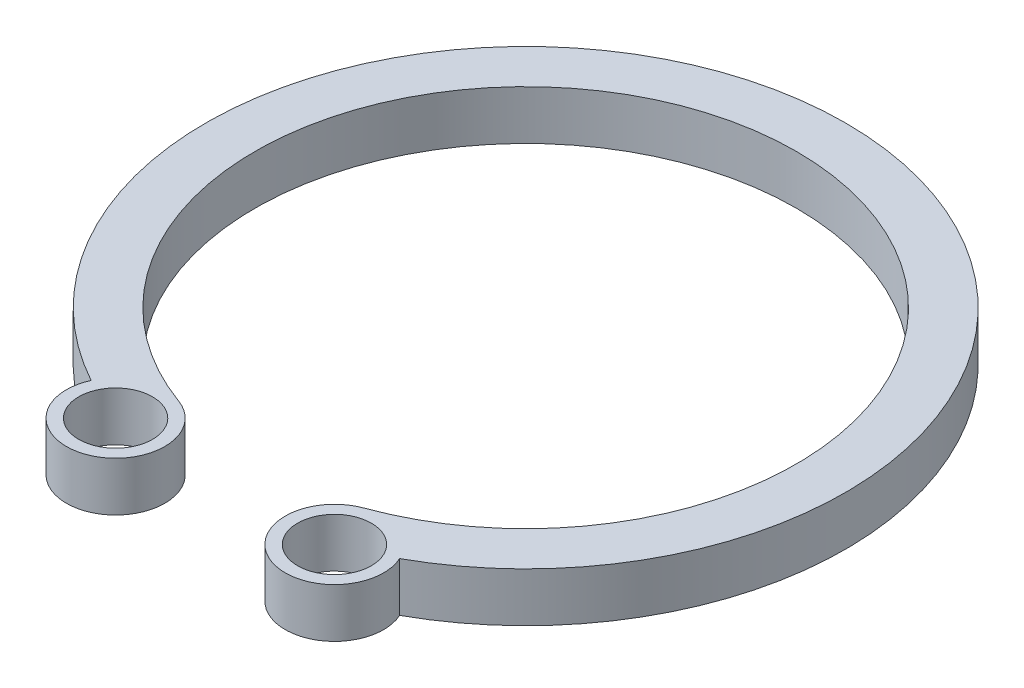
ISO-10303-21;
HEADER;
FILE_DESCRIPTION(('STEP AP214'),'2;1');
FILE_NAME('part.step','',(''),(''),'','','');
FILE_SCHEMA(('AUTOMOTIVE_DESIGN { 1 0 10303 214 1 1 1 1 }'));
ENDSEC;
DATA;
#1=APPLICATION_CONTEXT('core data for automotive mechanical design processes');
#2=APPLICATION_PROTOCOL_DEFINITION('international standard','automotive_design',2000,#1);
#3=PRODUCT_CONTEXT('',#1,'mechanical');
#4=PRODUCT('Part','Part','',(#3));
#5=PRODUCT_RELATED_PRODUCT_CATEGORY('part','',(#4));
#6=PRODUCT_DEFINITION_FORMATION('','',#4);
#7=PRODUCT_DEFINITION_CONTEXT('part definition',#1,'design');
#8=PRODUCT_DEFINITION('design','',#6,#7);
#9=PRODUCT_DEFINITION_SHAPE('','',#8);
#10=(LENGTH_UNIT() NAMED_UNIT(*) SI_UNIT(.MILLI.,.METRE.));
#11=(NAMED_UNIT(*) PLANE_ANGLE_UNIT() SI_UNIT($,.RADIAN.));
#12=(NAMED_UNIT(*) SI_UNIT($,.STERADIAN.) SOLID_ANGLE_UNIT());
#13=UNCERTAINTY_MEASURE_WITH_UNIT(LENGTH_MEASURE(1.E-05),#10,'distance_accuracy_value','');
#14=(GEOMETRIC_REPRESENTATION_CONTEXT(3) GLOBAL_UNCERTAINTY_ASSIGNED_CONTEXT((#13)) GLOBAL_UNIT_ASSIGNED_CONTEXT((#10,
#11,#12)) REPRESENTATION_CONTEXT('',''));
#15=CARTESIAN_POINT('',(0.,0.,0.));
#16=DIRECTION('',(0.,0.,1.));
#17=DIRECTION('',(1.,0.,0.));
#18=AXIS2_PLACEMENT_3D('',#15,#16,#17);
#19=CARTESIAN_POINT('',(-1.11156546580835,1.,3.05400101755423));
#20=DIRECTION('',(0.,1.,0.));
#21=DIRECTION('',(0.,0.,1.));
#22=AXIS2_PLACEMENT_3D('',#19,#20,#21);
#23=PLANE('',#22);
#24=CARTESIAN_POINT('',(-2.22313093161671,1.,6.10800203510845));
#25=DIRECTION('',(0.,1.,0.));
#26=DIRECTION('',(0.,0.,1.));
#27=AXIS2_PLACEMENT_3D('',#24,#25,#26);
#28=CIRCLE('',#27,0.75);
#29=CARTESIAN_POINT('',(-2.22313093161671,1.,6.85800203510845));
#30=VERTEX_POINT('',#29);
#31=EDGE_CURVE('E101',#30,#30,#28,.T.);
#32=ORIENTED_EDGE('',*,*,#31,.F.);
#33=EDGE_LOOP('',(#32));
#34=FACE_BOUND('',#33,.T.);
#35=CARTESIAN_POINT('',(-2.22313093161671,1.,6.10800203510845));
#36=DIRECTION('',(0.,1.,0.));
#37=DIRECTION('',(0.,0.,1.));
#38=AXIS2_PLACEMENT_3D('',#35,#36,#37);
#39=CIRCLE('',#38,0.999999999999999);
#40=CARTESIAN_POINT('',(-3.1337300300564,1.,5.6947112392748));
#41=VERTEX_POINT('',#40);
#42=CARTESIAN_POINT('',(-1.88111078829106,1.,5.16830941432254));
#43=VERTEX_POINT('',#42);
#44=EDGE_CURVE('E86',#41,#43,#39,.T.);
#45=ORIENTED_EDGE('',*,*,#44,.T.);
#46=CARTESIAN_POINT('',(0.,1.,0.));
#47=DIRECTION('',(0.,-1.,0.));
#48=DIRECTION('',(0.,0.,1.));
#49=AXIS2_PLACEMENT_3D('',#46,#47,#48);
#50=CIRCLE('',#49,5.5);
#51=CARTESIAN_POINT('',(1.88111078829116,1.,5.1683094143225));
#52=VERTEX_POINT('',#51);
#53=EDGE_CURVE('E81',#43,#52,#50,.T.);
#54=ORIENTED_EDGE('',*,*,#53,.T.);
#55=CARTESIAN_POINT('',(2.22313093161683,1.,6.10800203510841));
#56=DIRECTION('',(0.,1.,0.));
#57=DIRECTION('',(0.,0.,1.));
#58=AXIS2_PLACEMENT_3D('',#55,#56,#57);
#59=CIRCLE('',#58,0.999999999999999);
#60=CARTESIAN_POINT('',(3.13373003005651,1.,5.69471123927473));
#61=VERTEX_POINT('',#60);
#62=EDGE_CURVE('E84',#52,#61,#59,.T.);
#63=ORIENTED_EDGE('',*,*,#62,.T.);
#64=CARTESIAN_POINT('',(0.,1.,0.));
#65=DIRECTION('',(0.,1.,0.));
#66=DIRECTION('',(0.,0.,1.));
#67=AXIS2_PLACEMENT_3D('',#64,#65,#66);
#68=CIRCLE('',#67,6.5);
#69=EDGE_CURVE('E51',#61,#41,#68,.T.);
#70=ORIENTED_EDGE('',*,*,#69,.T.);
#71=EDGE_LOOP('',(#45,#54,#63,#70));
#72=FACE_BOUND('',#71,.T.);
#73=CARTESIAN_POINT('',(2.22313093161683,1.,6.10800203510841));
#74=DIRECTION('',(0.,1.,0.));
#75=DIRECTION('',(0.,0.,-1.));
#76=AXIS2_PLACEMENT_3D('',#73,#74,#75);
#77=CIRCLE('',#76,0.750000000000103);
#78=CARTESIAN_POINT('',(2.22313093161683,1.,5.35800203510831));
#79=VERTEX_POINT('',#78);
#80=EDGE_CURVE('E116',#79,#79,#77,.T.);
#81=ORIENTED_EDGE('',*,*,#80,.F.);
#82=EDGE_LOOP('',(#81));
#83=FACE_BOUND('',#82,.T.);
#84=ADVANCED_FACE('F34',(#34,#72,#83),#23,.T.);
#85=CARTESIAN_POINT('',(-1.11156546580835,0.,3.05400101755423));
#86=DIRECTION('',(0.,1.,0.));
#87=DIRECTION('',(0.,0.,1.));
#88=AXIS2_PLACEMENT_3D('',#85,#86,#87);
#89=PLANE('',#88);
#90=CARTESIAN_POINT('',(-2.22313093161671,0.,6.10800203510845));
#91=DIRECTION('',(0.,1.,0.));
#92=DIRECTION('',(0.,0.,1.));
#93=AXIS2_PLACEMENT_3D('',#90,#91,#92);
#94=CIRCLE('',#93,0.999999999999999);
#95=CARTESIAN_POINT('',(-3.1337300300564,0.,5.6947112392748));
#96=VERTEX_POINT('',#95);
#97=CARTESIAN_POINT('',(-1.88111078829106,0.,5.16830941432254));
#98=VERTEX_POINT('',#97);
#99=EDGE_CURVE('E98',#96,#98,#94,.T.);
#100=ORIENTED_EDGE('',*,*,#99,.F.);
#101=CARTESIAN_POINT('',(0.,0.,0.));
#102=DIRECTION('',(0.,1.,0.));
#103=DIRECTION('',(0.,0.,1.));
#104=AXIS2_PLACEMENT_3D('',#101,#102,#103);
#105=CIRCLE('',#104,6.5);
#106=CARTESIAN_POINT('',(3.13373003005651,0.,5.69471123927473));
#107=VERTEX_POINT('',#106);
#108=EDGE_CURVE('E74',#107,#96,#105,.T.);
#109=ORIENTED_EDGE('',*,*,#108,.F.);
#110=CARTESIAN_POINT('',(2.22313093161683,0.,6.10800203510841));
#111=DIRECTION('',(0.,1.,0.));
#112=DIRECTION('',(0.,0.,1.));
#113=AXIS2_PLACEMENT_3D('',#110,#111,#112);
#114=CIRCLE('',#113,0.999999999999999);
#115=CARTESIAN_POINT('',(1.88111078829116,0.,5.1683094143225));
#116=VERTEX_POINT('',#115);
#117=EDGE_CURVE('E68',#116,#107,#114,.T.);
#118=ORIENTED_EDGE('',*,*,#117,.F.);
#119=CARTESIAN_POINT('',(0.,0.,0.));
#120=DIRECTION('',(0.,-1.,0.));
#121=DIRECTION('',(0.,0.,1.));
#122=AXIS2_PLACEMENT_3D('',#119,#120,#121);
#123=CIRCLE('',#122,5.5);
#124=EDGE_CURVE('E90',#98,#116,#123,.T.);
#125=ORIENTED_EDGE('',*,*,#124,.F.);
#126=EDGE_LOOP('',(#100,#109,#118,#125));
#127=FACE_BOUND('',#126,.T.);
#128=CARTESIAN_POINT('',(-2.22313093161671,0.,6.10800203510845));
#129=DIRECTION('',(0.,1.,0.));
#130=DIRECTION('',(0.,0.,1.));
#131=AXIS2_PLACEMENT_3D('',#128,#129,#130);
#132=CIRCLE('',#131,0.75);
#133=CARTESIAN_POINT('',(-2.22313093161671,0.,6.85800203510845));
#134=VERTEX_POINT('',#133);
#135=EDGE_CURVE('E113',#134,#134,#132,.T.);
#136=ORIENTED_EDGE('',*,*,#135,.T.);
#137=EDGE_LOOP('',(#136));
#138=FACE_BOUND('',#137,.T.);
#139=CARTESIAN_POINT('',(2.22313093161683,0.,6.10800203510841));
#140=DIRECTION('',(0.,1.,0.));
#141=DIRECTION('',(0.,0.,-1.));
#142=AXIS2_PLACEMENT_3D('',#139,#140,#141);
#143=CIRCLE('',#142,0.750000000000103);
#144=CARTESIAN_POINT('',(2.22313093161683,0.,5.35800203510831));
#145=VERTEX_POINT('',#144);
#146=EDGE_CURVE('E119',#145,#145,#143,.T.);
#147=ORIENTED_EDGE('',*,*,#146,.T.);
#148=EDGE_LOOP('',(#147));
#149=FACE_BOUND('',#148,.T.);
#150=ADVANCED_FACE('F109',(#127,#138,#149),#89,.F.);
#151=CARTESIAN_POINT('',(-2.22313093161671,1.,6.10800203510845));
#152=DIRECTION('',(0.,-1.,0.));
#153=DIRECTION('',(0.,0.,-1.));
#154=AXIS2_PLACEMENT_3D('',#151,#152,#153);
#155=CYLINDRICAL_SURFACE('',#154,0.999999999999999);
#156=ORIENTED_EDGE('',*,*,#99,.T.);
#157=DIRECTION('',(0.,-1.,0.));
#158=VECTOR('',#157,1.);
#159=CARTESIAN_POINT('',(-1.88111078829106,1.,5.16830941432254));
#160=LINE('',#159,#158);
#161=EDGE_CURVE('E11',#43,#98,#160,.T.);
#162=ORIENTED_EDGE('',*,*,#161,.F.);
#163=ORIENTED_EDGE('',*,*,#44,.F.);
#164=DIRECTION('',(0.,-1.,0.));
#165=VECTOR('',#164,1.);
#166=CARTESIAN_POINT('',(-3.1337300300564,1.,5.6947112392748));
#167=LINE('',#166,#165);
#168=EDGE_CURVE('E94',#41,#96,#167,.T.);
#169=ORIENTED_EDGE('',*,*,#168,.T.);
#170=EDGE_LOOP('',(#156,#162,#163,#169));
#171=FACE_BOUND('',#170,.T.);
#172=ADVANCED_FACE('F36',(#171),#155,.T.);
#173=CARTESIAN_POINT('',(0.,1.,0.));
#174=DIRECTION('',(0.,-1.,0.));
#175=DIRECTION('',(0.,0.,-1.));
#176=AXIS2_PLACEMENT_3D('',#173,#174,#175);
#177=CYLINDRICAL_SURFACE('',#176,5.5);
#178=ORIENTED_EDGE('',*,*,#124,.T.);
#179=DIRECTION('',(0.,-1.,0.));
#180=VECTOR('',#179,1.);
#181=CARTESIAN_POINT('',(1.88111078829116,1.,5.1683094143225));
#182=LINE('',#181,#180);
#183=EDGE_CURVE('E43',#52,#116,#182,.T.);
#184=ORIENTED_EDGE('',*,*,#183,.F.);
#185=ORIENTED_EDGE('',*,*,#53,.F.);
#186=ORIENTED_EDGE('',*,*,#161,.T.);
#187=EDGE_LOOP('',(#178,#184,#185,#186));
#188=FACE_BOUND('',#187,.T.);
#189=ADVANCED_FACE('F89',(#188),#177,.F.);
#190=CARTESIAN_POINT('',(2.22313093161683,1.,6.10800203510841));
#191=DIRECTION('',(0.,-1.,0.));
#192=DIRECTION('',(0.,0.,-1.));
#193=AXIS2_PLACEMENT_3D('',#190,#191,#192);
#194=CYLINDRICAL_SURFACE('',#193,0.999999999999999);
#195=ORIENTED_EDGE('',*,*,#117,.T.);
#196=DIRECTION('',(0.,-1.,0.));
#197=VECTOR('',#196,1.);
#198=CARTESIAN_POINT('',(3.13373003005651,1.,5.69471123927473));
#199=LINE('',#198,#197);
#200=EDGE_CURVE('E91',#61,#107,#199,.T.);
#201=ORIENTED_EDGE('',*,*,#200,.F.);
#202=ORIENTED_EDGE('',*,*,#62,.F.);
#203=ORIENTED_EDGE('',*,*,#183,.T.);
#204=EDGE_LOOP('',(#195,#201,#202,#203));
#205=FACE_BOUND('',#204,.T.);
#206=ADVANCED_FACE('F92',(#205),#194,.T.);
#207=CARTESIAN_POINT('',(0.,1.,0.));
#208=DIRECTION('',(0.,-1.,0.));
#209=DIRECTION('',(0.,0.,-1.));
#210=AXIS2_PLACEMENT_3D('',#207,#208,#209);
#211=CYLINDRICAL_SURFACE('',#210,6.5);
#212=ORIENTED_EDGE('',*,*,#108,.T.);
#213=ORIENTED_EDGE('',*,*,#168,.F.);
#214=ORIENTED_EDGE('',*,*,#69,.F.);
#215=ORIENTED_EDGE('',*,*,#200,.T.);
#216=EDGE_LOOP('',(#212,#213,#214,#215));
#217=FACE_BOUND('',#216,.T.);
#218=ADVANCED_FACE('F106',(#217),#211,.T.);
#219=CARTESIAN_POINT('',(-2.22313093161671,1.,6.10800203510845));
#220=DIRECTION('',(0.,-1.,0.));
#221=DIRECTION('',(0.,0.,-1.));
#222=AXIS2_PLACEMENT_3D('',#219,#220,#221);
#223=CYLINDRICAL_SURFACE('',#222,0.75);
#224=ORIENTED_EDGE('',*,*,#31,.T.);
#225=EDGE_LOOP('',(#224));
#226=FACE_BOUND('',#225,.T.);
#227=ORIENTED_EDGE('',*,*,#135,.F.);
#228=EDGE_LOOP('',(#227));
#229=FACE_BOUND('',#228,.T.);
#230=ADVANCED_FACE('F136',(#226,#229),#223,.F.);
#231=CARTESIAN_POINT('',(2.22313093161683,1.,6.10800203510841));
#232=DIRECTION('',(0.,-1.,0.));
#233=DIRECTION('',(0.,0.,-1.));
#234=AXIS2_PLACEMENT_3D('',#231,#232,#233);
#235=CYLINDRICAL_SURFACE('',#234,0.750000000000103);
#236=ORIENTED_EDGE('',*,*,#80,.T.);
#237=EDGE_LOOP('',(#236));
#238=FACE_BOUND('',#237,.T.);
#239=ORIENTED_EDGE('',*,*,#146,.F.);
#240=EDGE_LOOP('',(#239));
#241=FACE_BOUND('',#240,.T.);
#242=ADVANCED_FACE('F125',(#238,#241),#235,.F.);
#243=CLOSED_SHELL('',(#84,#150,#172,#189,#206,#218,#230,#242));
#244=MANIFOLD_SOLID_BREP('B2',#243);
#245=ADVANCED_BREP_SHAPE_REPRESENTATION('',(#18,#244),#14);
#246=SHAPE_DEFINITION_REPRESENTATION(#9,#245);
ENDSEC;
END-ISO-10303-21;
